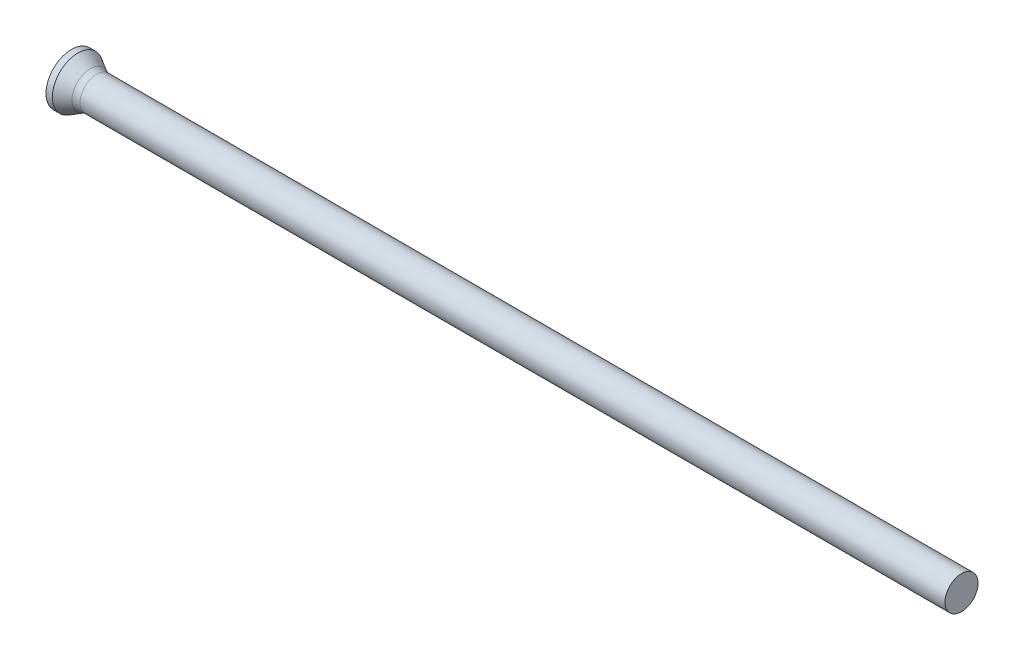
ISO-10303-21;
HEADER;
FILE_DESCRIPTION(('STEP AP214'),'2;1');
FILE_NAME('part.step','',(''),(''),'','','');
FILE_SCHEMA(('AUTOMOTIVE_DESIGN { 1 0 10303 214 1 1 1 1 }'));
ENDSEC;
DATA;
#1=APPLICATION_CONTEXT('core data for automotive mechanical design processes');
#2=APPLICATION_PROTOCOL_DEFINITION('international standard','automotive_design',2000,#1);
#3=PRODUCT_CONTEXT('',#1,'mechanical');
#4=PRODUCT('Part','Part','',(#3));
#5=PRODUCT_RELATED_PRODUCT_CATEGORY('part','',(#4));
#6=PRODUCT_DEFINITION_FORMATION('','',#4);
#7=PRODUCT_DEFINITION_CONTEXT('part definition',#1,'design');
#8=PRODUCT_DEFINITION('design','',#6,#7);
#9=PRODUCT_DEFINITION_SHAPE('','',#8);
#10=(LENGTH_UNIT() NAMED_UNIT(*) SI_UNIT(.MILLI.,.METRE.));
#11=(NAMED_UNIT(*) PLANE_ANGLE_UNIT() SI_UNIT($,.RADIAN.));
#12=(NAMED_UNIT(*) SI_UNIT($,.STERADIAN.) SOLID_ANGLE_UNIT());
#13=UNCERTAINTY_MEASURE_WITH_UNIT(LENGTH_MEASURE(1.E-05),#10,'distance_accuracy_value','');
#14=(GEOMETRIC_REPRESENTATION_CONTEXT(3) GLOBAL_UNCERTAINTY_ASSIGNED_CONTEXT((#13)) GLOBAL_UNIT_ASSIGNED_CONTEXT((#10,
#11,#12)) REPRESENTATION_CONTEXT('',''));
#15=CARTESIAN_POINT('',(0.,0.,0.));
#16=DIRECTION('',(0.,0.,1.));
#17=DIRECTION('',(1.,0.,0.));
#18=AXIS2_PLACEMENT_3D('',#15,#16,#17);
#19=CARTESIAN_POINT('',(0.,0.,0.));
#20=DIRECTION('',(1.,0.,0.));
#21=DIRECTION('',(0.,0.,-1.));
#22=AXIS2_PLACEMENT_3D('',#19,#20,#21);
#23=PLANE('',#22);
#24=CARTESIAN_POINT('',(0.,0.,0.));
#25=DIRECTION('',(-1.,0.,0.));
#26=DIRECTION('',(0.,0.,1.));
#27=AXIS2_PLACEMENT_3D('',#24,#25,#26);
#28=CIRCLE('',#27,2.);
#29=CARTESIAN_POINT('',(0.,0.,2.));
#30=VERTEX_POINT('',#29);
#31=EDGE_CURVE('E25',#30,#30,#28,.T.);
#32=ORIENTED_EDGE('',*,*,#31,.T.);
#33=EDGE_LOOP('',(#32));
#34=FACE_BOUND('',#33,.T.);
#35=ADVANCED_FACE('F14',(#34),#23,.F.);
#36=CARTESIAN_POINT('',(0.,0.,0.));
#37=DIRECTION('',(-1.,0.,0.));
#38=DIRECTION('',(0.,0.,1.));
#39=AXIS2_PLACEMENT_3D('',#36,#37,#38);
#40=CYLINDRICAL_SURFACE('',#39,2.);
#41=ORIENTED_EDGE('',*,*,#31,.F.);
#42=EDGE_LOOP('',(#41));
#43=FACE_BOUND('',#42,.T.);
#44=CARTESIAN_POINT('',(0.497564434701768,0.,0.));
#45=DIRECTION('',(-1.,0.,0.));
#46=DIRECTION('',(0.,0.,1.));
#47=AXIS2_PLACEMENT_3D('',#44,#45,#46);
#48=CIRCLE('',#47,2.);
#49=CARTESIAN_POINT('',(0.497564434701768,0.,2.));
#50=VERTEX_POINT('',#49);
#51=EDGE_CURVE('E29',#50,#50,#48,.T.);
#52=ORIENTED_EDGE('',*,*,#51,.T.);
#53=EDGE_LOOP('',(#52));
#54=FACE_BOUND('',#53,.T.);
#55=ADVANCED_FACE('F53',(#43,#54),#40,.T.);
#56=CARTESIAN_POINT('',(1.71,0.,0.));
#57=DIRECTION('',(-1.,0.,0.));
#58=DIRECTION('',(0.,0.,1.));
#59=AXIS2_PLACEMENT_3D('',#56,#57,#58);
#60=CONICAL_SURFACE('',#59,1.3,0.523598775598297);
#61=CARTESIAN_POINT('',(1.47794919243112,0.,0.));
#62=DIRECTION('',(-1.,0.,0.));
#63=DIRECTION('',(0.,0.,1.));
#64=AXIS2_PLACEMENT_3D('',#61,#62,#63);
#65=CIRCLE('',#64,1.43397459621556);
#66=CARTESIAN_POINT('',(1.47794919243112,0.,1.43397459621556));
#67=VERTEX_POINT('',#66);
#68=EDGE_CURVE('E21',#67,#67,#65,.T.);
#69=ORIENTED_EDGE('',*,*,#68,.T.);
#70=EDGE_LOOP('',(#69));
#71=FACE_BOUND('',#70,.T.);
#72=ORIENTED_EDGE('',*,*,#51,.F.);
#73=EDGE_LOOP('',(#72));
#74=FACE_BOUND('',#73,.T.);
#75=ADVANCED_FACE('F50',(#71,#74),#60,.T.);
#76=CARTESIAN_POINT('',(0.,0.,0.));
#77=DIRECTION('',(-1.,0.,0.));
#78=DIRECTION('',(0.,0.,1.));
#79=AXIS2_PLACEMENT_3D('',#76,#77,#78);
#80=CYLINDRICAL_SURFACE('',#79,1.3);
#81=CARTESIAN_POINT('',(1.97794919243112,0.,0.));
#82=DIRECTION('',(-1.,0.,0.));
#83=DIRECTION('',(0.,0.,1.));
#84=AXIS2_PLACEMENT_3D('',#81,#82,#83);
#85=CIRCLE('',#84,1.3);
#86=CARTESIAN_POINT('',(1.97794919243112,0.,1.3));
#87=VERTEX_POINT('',#86);
#88=EDGE_CURVE('E9',#87,#87,#85,.F.);
#89=ORIENTED_EDGE('',*,*,#88,.T.);
#90=EDGE_LOOP('',(#89));
#91=FACE_BOUND('',#90,.T.);
#92=CARTESIAN_POINT('',(70.,0.,0.));
#93=DIRECTION('',(-1.,0.,0.));
#94=DIRECTION('',(0.,0.,1.));
#95=AXIS2_PLACEMENT_3D('',#92,#93,#94);
#96=CIRCLE('',#95,1.3);
#97=CARTESIAN_POINT('',(70.,0.,1.3));
#98=VERTEX_POINT('',#97);
#99=EDGE_CURVE('E34',#98,#98,#96,.T.);
#100=ORIENTED_EDGE('',*,*,#99,.T.);
#101=EDGE_LOOP('',(#100));
#102=FACE_BOUND('',#101,.T.);
#103=ADVANCED_FACE('F38',(#91,#102),#80,.T.);
#104=CARTESIAN_POINT('',(70.,1.3,0.));
#105=DIRECTION('',(-1.,0.,0.));
#106=DIRECTION('',(0.,0.,1.));
#107=AXIS2_PLACEMENT_3D('',#104,#105,#106);
#108=PLANE('',#107);
#109=ORIENTED_EDGE('',*,*,#99,.F.);
#110=EDGE_LOOP('',(#109));
#111=FACE_BOUND('',#110,.T.);
#112=ADVANCED_FACE('F40',(#111),#108,.F.);
#113=CARTESIAN_POINT('',(1.97794919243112,0.,0.));
#114=DIRECTION('',(-1.,0.,0.));
#115=DIRECTION('',(0.,0.,1.));
#116=AXIS2_PLACEMENT_3D('',#113,#114,#115);
#117=TOROIDAL_SURFACE('',#116,2.3,1.);
#118=ORIENTED_EDGE('',*,*,#88,.F.);
#119=EDGE_LOOP('',(#118));
#120=FACE_BOUND('',#119,.T.);
#121=ORIENTED_EDGE('',*,*,#68,.F.);
#122=EDGE_LOOP('',(#121));
#123=FACE_BOUND('',#122,.T.);
#124=ADVANCED_FACE('F16',(#120,#123),#117,.F.);
#125=CLOSED_SHELL('',(#35,#55,#75,#103,#112,#124));
#126=MANIFOLD_SOLID_BREP('B1',#125);
#127=ADVANCED_BREP_SHAPE_REPRESENTATION('',(#18,#126),#14);
#128=SHAPE_DEFINITION_REPRESENTATION(#9,#127);
ENDSEC;
END-ISO-10303-21;
